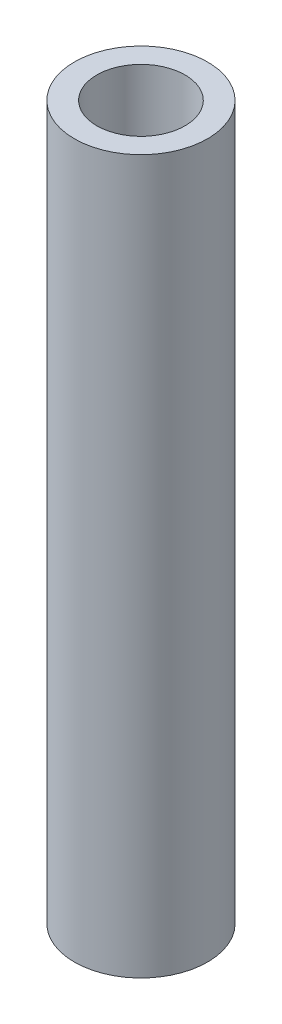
from build123d import *

# Parameters (mm, degrees)
SKETCH2_R            = 4
BOSS_EXTRUDE1_DEPTH  = 21.42
M5_CLEARANCE_HOLE1_D = 5.3


with BuildPart() as part:
    # Sketch2 → Boss-Extrude1 (new, symmetric)
    with BuildSketch(Plane(origin=(0, 0, 0), x_dir=(1, 0, 0), z_dir=(0, 1, 0))):
        with Locations(Location((0, 0, 0), (0, 0, 270))):
            Circle(SKETCH2_R)
    extrude(amount=BOSS_EXTRUDE1_DEPTH, both=True)

    # M5 Clearance Hole1 (through all)
    with Locations(Plane(origin=(0, 21.42, 0), x_dir=(1, 0, 0), z_dir=(0, 1, 0))):
        with Locations((0, 0)):
            Hole(M5_CLEARANCE_HOLE1_D / 2)


solid = part.part
